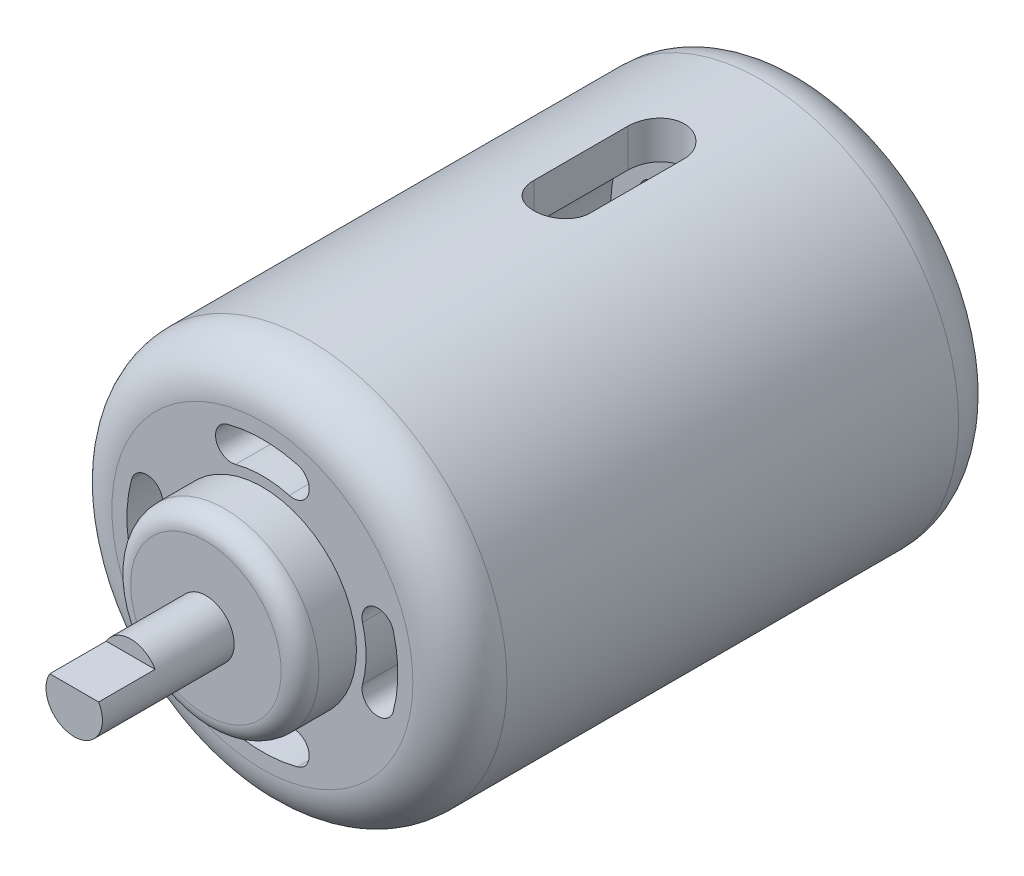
from build123d import *

# Parameters (mm, degrees)
ESQUISSE1_R             = 10.5
EXTRUSION1_DEPTH        = 27
ESQUISSE2_R             = 5
EXTRUSION2_DEPTH        = 3
COQUE5_T                = -2
ESQUISSE3_R             = 1.5
EXTRUSION3_DEPTH        = 7
ESQUISSE4_W             = 4.086398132
ESQUISSE4_H             = 2.124927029
ENL_V_MAT_EXTRU_1_DEPTH = 3
ENL_V_MAT_EXTRU_2_DEPTH = 20
EXTRUSION4_START        = 2
ESQUISSE6_R             = 10.5
EXTRUSION4_DEPTH        = 2
CONG_3_R                = 2.5
CONG_4_R                = 1
ENL_V_MAT_EXTRU_3_DEPTH = 33.580669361


with BuildPart() as part:
    # Esquisse1 → Extrusion1 (new body)
    with BuildSketch(Plane.XY):
        Circle(ESQUISSE1_R)
    extrude(amount=EXTRUSION1_DEPTH)

    # Esquisse2 → Extrusion2 (add)
    with BuildSketch(Plane.XY.offset(27)):
        Circle(ESQUISSE2_R)
    extrude(amount=EXTRUSION2_DEPTH)

    # Coque5
    coque5_openings = [part.faces().sort_by_distance(p)[0] for p in [
        (0, 0, 0),
    ]]
    offset(amount=COQUE5_T, openings=coque5_openings, kind=Kind.INTERSECTION)

    # Esquisse3 → Extrusion3 (add)
    with BuildSketch(Plane.XY.offset(30)):
        Circle(ESQUISSE3_R)
    extrude(amount=EXTRUSION3_DEPTH)

    # Esquisse4 → Enl_v. mat.-Extru.1 (cut)
    with BuildSketch(Plane.XY.offset(37)):
        with Locations((0.245183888, 1.812463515)):
            Rectangle(ESQUISSE4_W, ESQUISSE4_H)
    extrude(amount=-ENL_V_MAT_EXTRU_1_DEPTH, mode=Mode.SUBTRACT)

    # Esquisse5 → Enl_v. mat.-Extru.2 (cut, symmetric)
    with BuildSketch(Plane(origin=(0, 0, 0), x_dir=(1, 0, 0), z_dir=(0, 1, 0))):
        with BuildLine():
            Line((-1.5, -6.077349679), (-1.5, -11.077349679))
            ThreePointArc((-1.5, -11.077349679), (0, -12.577349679), (1.5, -11.077349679))
            Line((1.5, -11.077349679), (1.5, -6.077349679))
            ThreePointArc((1.5, -6.077349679), (0, -4.577349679), (-1.5, -6.077349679))
        make_face()
    extrude(amount=ENL_V_MAT_EXTRU_2_DEPTH, both=True, mode=Mode.SUBTRACT)

    # Esquisse6 → Extrusion4 (add)
    with BuildSketch(Plane(origin=(0, 0, 0), x_dir=(-1, 0, 0), z_dir=(0, 0, -1)).offset(EXTRUSION4_START)):
        Circle(ESQUISSE6_R)
    extrude(amount=-EXTRUSION4_DEPTH)

    # Cong_3
    cong_3_edges = [part.edges().sort_by_distance(p)[0] for p in [
        (-10.5, 0, 27),
        (10.5, 0, -2),
    ]]
    fillet(cong_3_edges, radius=CONG_3_R)

    # Cong_4
    cong_4_edges = [part.edges().sort_by_distance(p)[0] for p in [
        (-5, 0, 30),
    ]]
    fillet(cong_4_edges, radius=CONG_4_R)

    # Esquisse7 → Enl_v. mat.-Extru.3 (cut, through all)
    with BuildSketch(Plane.XY.offset(27)):
        with BuildLine():
            ThreePointArc((1.426466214, 5.323644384), (0, 5.511442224), (-1.426466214, 5.323644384))
            ThreePointArc((-1.426466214, 5.323644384), (-2.460492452, 5.920639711), (-1.863497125, 6.954665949))
            ThreePointArc((-1.863497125, 6.954665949), (0, 7.2), (1.863497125, 6.954665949))
            ThreePointArc((1.863497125, 6.954665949), (2.460492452, 5.920639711), (1.426466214, 5.323644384))
        make_face()
        with BuildLine():
            ThreePointArc((5.323644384, -1.426466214), (5.511442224, 0), (5.323644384, 1.426466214))
            ThreePointArc((5.323644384, 1.426466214), (5.920639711, 2.460492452), (6.954665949, 1.863497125))
            ThreePointArc((6.954665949, 1.863497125), (7.2, 0), (6.954665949, -1.863497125))
            ThreePointArc((6.954665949, -1.863497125), (5.920639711, -2.460492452), (5.323644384, -1.426466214))
        make_face()
        with BuildLine():
            ThreePointArc((-1.426466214, -5.323644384), (0, -5.511442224), (1.426466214, -5.323644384))
            ThreePointArc((1.426466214, -5.323644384), (2.460492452, -5.920639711), (1.863497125, -6.954665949))
            ThreePointArc((1.863497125, -6.954665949), (0, -7.2), (-1.863497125, -6.954665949))
            ThreePointArc((-1.863497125, -6.954665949), (-2.460492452, -5.920639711), (-1.426466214, -5.323644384))
        make_face()
        with BuildLine():
            ThreePointArc((-5.323644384, 1.426466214), (-5.511442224, 0), (-5.323644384, -1.426466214))
            ThreePointArc((-5.323644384, -1.426466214), (-5.920639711, -2.460492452), (-6.954665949, -1.863497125))
            ThreePointArc((-6.954665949, -1.863497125), (-7.2, 0), (-6.954665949, 1.863497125))
            ThreePointArc((-6.954665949, 1.863497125), (-5.920639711, 2.460492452), (-5.323644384, 1.426466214))
        make_face()
    extrude(amount=-ENL_V_MAT_EXTRU_3_DEPTH, mode=Mode.SUBTRACT)


solid = part.part
